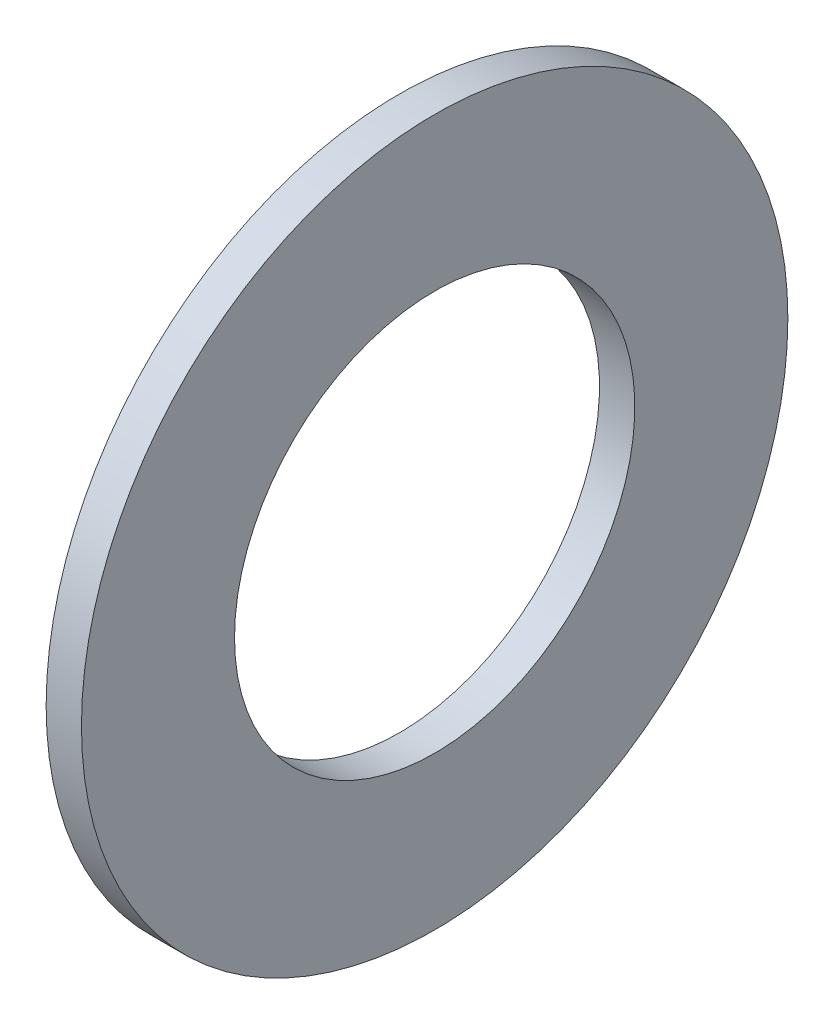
from build123d import *

# Parameters (mm, degrees)
ESQUISSE1_W = 1.5
ESQUISSE1_H = 6.5


with BuildPart() as part:
    # Esquisse1 → Base-R_volution (revolve)
    with BuildSketch(Plane(origin=(0, 0, 0), x_dir=(1, 0, 0), z_dir=(0, 1, 0)), mode=Mode.PRIVATE) as base_r_volution_sk:
        with Locations((0.75, 11.75)):
            Rectangle(ESQUISSE1_W, ESQUISSE1_H)
    revolve(base_r_volution_sk.sketch.rotate(Axis((0, 0, 0), (1, 0, 0)), 180), axis=Axis((0, 0, 0), (1, 0, 0)))


solid = part.part
